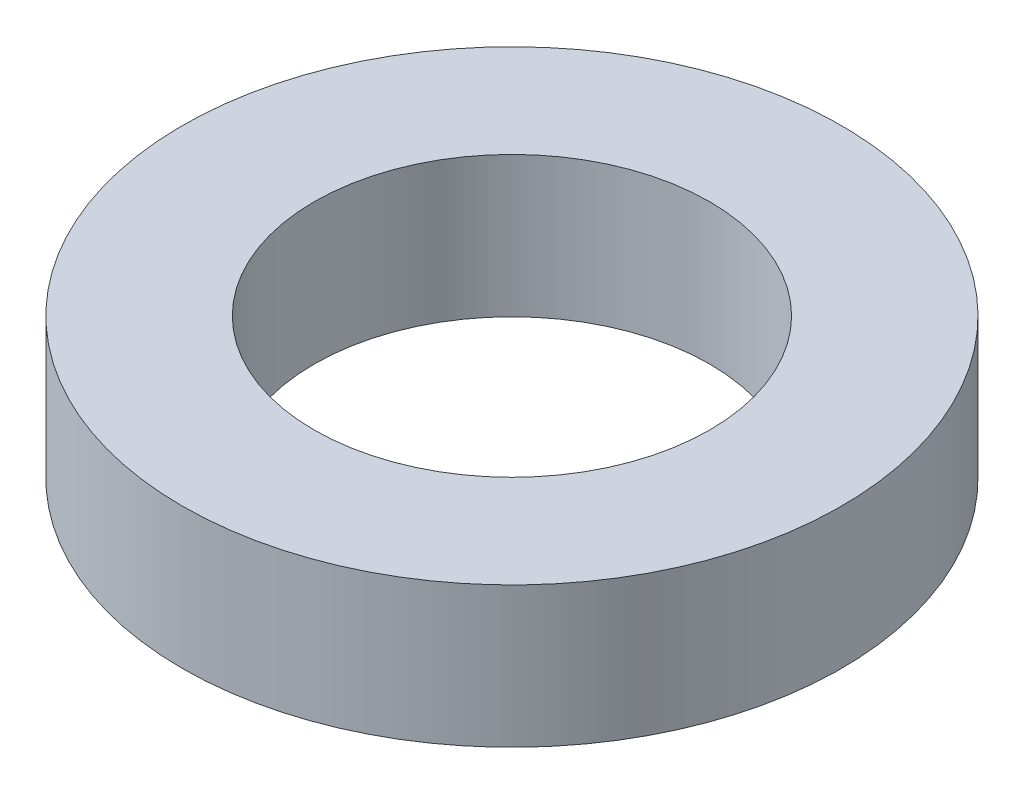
ISO-10303-21;
HEADER;
FILE_DESCRIPTION(('STEP AP214'),'2;1');
FILE_NAME('part.step','',(''),(''),'','','');
FILE_SCHEMA(('AUTOMOTIVE_DESIGN { 1 0 10303 214 1 1 1 1 }'));
ENDSEC;
DATA;
#1=APPLICATION_CONTEXT('core data for automotive mechanical design processes');
#2=APPLICATION_PROTOCOL_DEFINITION('international standard','automotive_design',2000,#1);
#3=PRODUCT_CONTEXT('',#1,'mechanical');
#4=PRODUCT('Part','Part','',(#3));
#5=PRODUCT_RELATED_PRODUCT_CATEGORY('part','',(#4));
#6=PRODUCT_DEFINITION_FORMATION('','',#4);
#7=PRODUCT_DEFINITION_CONTEXT('part definition',#1,'design');
#8=PRODUCT_DEFINITION('design','',#6,#7);
#9=PRODUCT_DEFINITION_SHAPE('','',#8);
#10=(LENGTH_UNIT() NAMED_UNIT(*) SI_UNIT(.MILLI.,.METRE.));
#11=(NAMED_UNIT(*) PLANE_ANGLE_UNIT() SI_UNIT($,.RADIAN.));
#12=(NAMED_UNIT(*) SI_UNIT($,.STERADIAN.) SOLID_ANGLE_UNIT());
#13=UNCERTAINTY_MEASURE_WITH_UNIT(LENGTH_MEASURE(1.E-05),#10,'distance_accuracy_value','');
#14=(GEOMETRIC_REPRESENTATION_CONTEXT(3) GLOBAL_UNCERTAINTY_ASSIGNED_CONTEXT((#13)) GLOBAL_UNIT_ASSIGNED_CONTEXT((#10,
#11,#12)) REPRESENTATION_CONTEXT('',''));
#15=CARTESIAN_POINT('',(0.,0.,0.));
#16=DIRECTION('',(0.,0.,1.));
#17=DIRECTION('',(1.,0.,0.));
#18=AXIS2_PLACEMENT_3D('',#15,#16,#17);
#19=CARTESIAN_POINT('',(0.,-10.16,0.));
#20=DIRECTION('',(0.,1.,0.));
#21=DIRECTION('',(0.,0.,1.));
#22=AXIS2_PLACEMENT_3D('',#19,#20,#21);
#23=CYLINDRICAL_SURFACE('',#22,23.8125);
#24=CARTESIAN_POINT('',(0.,-10.16,0.));
#25=DIRECTION('',(0.,1.,0.));
#26=DIRECTION('',(0.,0.,1.));
#27=AXIS2_PLACEMENT_3D('',#24,#25,#26);
#28=CIRCLE('',#27,23.8125);
#29=CARTESIAN_POINT('',(0.,-10.16,23.8125));
#30=VERTEX_POINT('',#29);
#31=EDGE_CURVE('E10',#30,#30,#28,.T.);
#32=ORIENTED_EDGE('',*,*,#31,.T.);
#33=EDGE_LOOP('',(#32));
#34=FACE_BOUND('',#33,.T.);
#35=CARTESIAN_POINT('',(0.,0.,0.));
#36=DIRECTION('',(0.,1.,0.));
#37=DIRECTION('',(0.,0.,1.));
#38=AXIS2_PLACEMENT_3D('',#35,#36,#37);
#39=CIRCLE('',#38,23.8125);
#40=CARTESIAN_POINT('',(0.,0.,23.8125));
#41=VERTEX_POINT('',#40);
#42=EDGE_CURVE('E33',#41,#41,#39,.T.);
#43=ORIENTED_EDGE('',*,*,#42,.F.);
#44=EDGE_LOOP('',(#43));
#45=FACE_BOUND('',#44,.T.);
#46=ADVANCED_FACE('F30',(#34,#45),#23,.T.);
#47=CARTESIAN_POINT('',(0.,-10.16,0.));
#48=DIRECTION('',(0.,1.,0.));
#49=DIRECTION('',(0.,0.,1.));
#50=AXIS2_PLACEMENT_3D('',#47,#48,#49);
#51=PLANE('',#50);
#52=CARTESIAN_POINT('',(0.,-10.16,0.));
#53=DIRECTION('',(0.,1.,0.));
#54=DIRECTION('',(0.,0.,1.));
#55=AXIS2_PLACEMENT_3D('',#52,#53,#54);
#56=CIRCLE('',#55,14.2875);
#57=CARTESIAN_POINT('',(0.,-10.16,14.2875));
#58=VERTEX_POINT('',#57);
#59=EDGE_CURVE('E40',#58,#58,#56,.T.);
#60=ORIENTED_EDGE('',*,*,#59,.T.);
#61=EDGE_LOOP('',(#60));
#62=FACE_BOUND('',#61,.T.);
#63=ORIENTED_EDGE('',*,*,#31,.F.);
#64=EDGE_LOOP('',(#63));
#65=FACE_BOUND('',#64,.T.);
#66=ADVANCED_FACE('F48',(#62,#65),#51,.F.);
#67=CARTESIAN_POINT('',(0.,0.,0.));
#68=DIRECTION('',(0.,1.,0.));
#69=DIRECTION('',(0.,0.,1.));
#70=AXIS2_PLACEMENT_3D('',#67,#68,#69);
#71=PLANE('',#70);
#72=CARTESIAN_POINT('',(0.,0.,0.));
#73=DIRECTION('',(0.,1.,0.));
#74=DIRECTION('',(0.,0.,1.));
#75=AXIS2_PLACEMENT_3D('',#72,#73,#74);
#76=CIRCLE('',#75,14.2875);
#77=CARTESIAN_POINT('',(0.,0.,14.2875));
#78=VERTEX_POINT('',#77);
#79=EDGE_CURVE('E42',#78,#78,#76,.T.);
#80=ORIENTED_EDGE('',*,*,#79,.F.);
#81=EDGE_LOOP('',(#80));
#82=FACE_BOUND('',#81,.T.);
#83=ORIENTED_EDGE('',*,*,#42,.T.);
#84=EDGE_LOOP('',(#83));
#85=FACE_BOUND('',#84,.T.);
#86=ADVANCED_FACE('F54',(#82,#85),#71,.T.);
#87=CARTESIAN_POINT('',(0.,-10.16,0.));
#88=DIRECTION('',(0.,1.,0.));
#89=DIRECTION('',(0.,0.,1.));
#90=AXIS2_PLACEMENT_3D('',#87,#88,#89);
#91=CYLINDRICAL_SURFACE('',#90,14.2875);
#92=ORIENTED_EDGE('',*,*,#59,.F.);
#93=EDGE_LOOP('',(#92));
#94=FACE_BOUND('',#93,.T.);
#95=ORIENTED_EDGE('',*,*,#79,.T.);
#96=EDGE_LOOP('',(#95));
#97=FACE_BOUND('',#96,.T.);
#98=ADVANCED_FACE('F51',(#94,#97),#91,.F.);
#99=CLOSED_SHELL('',(#46,#66,#86,#98));
#100=MANIFOLD_SOLID_BREP('B2',#99);
#101=ADVANCED_BREP_SHAPE_REPRESENTATION('',(#18,#100),#14);
#102=SHAPE_DEFINITION_REPRESENTATION(#9,#101);
ENDSEC;
END-ISO-10303-21;
